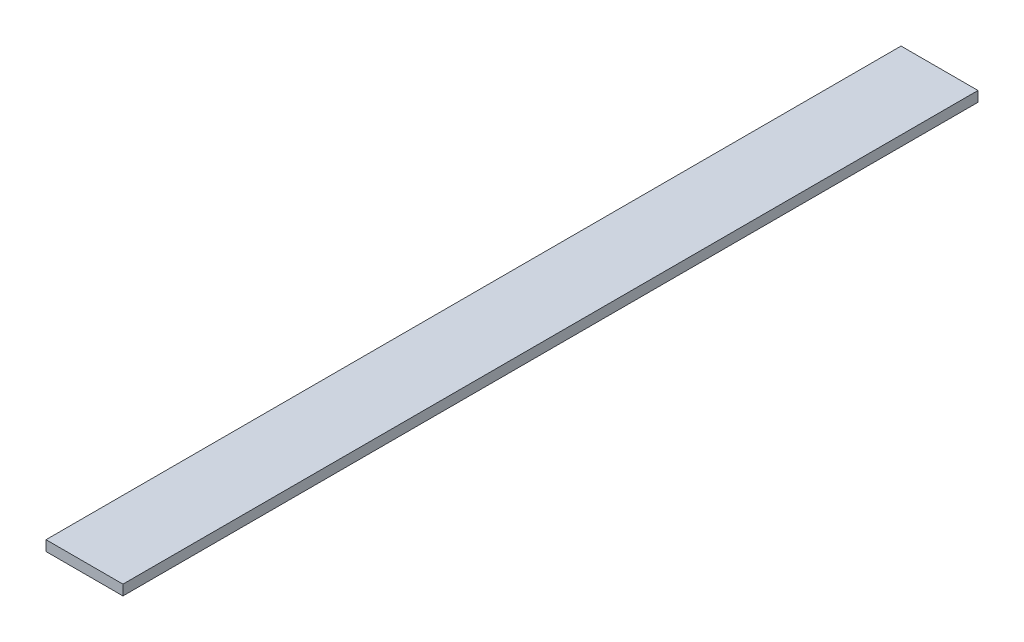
ISO-10303-21;
HEADER;
FILE_DESCRIPTION(('STEP AP214'),'2;1');
FILE_NAME('part.step','',(''),(''),'','','');
FILE_SCHEMA(('AUTOMOTIVE_DESIGN { 1 0 10303 214 1 1 1 1 }'));
ENDSEC;
DATA;
#1=APPLICATION_CONTEXT('core data for automotive mechanical design processes');
#2=APPLICATION_PROTOCOL_DEFINITION('international standard','automotive_design',2000,#1);
#3=PRODUCT_CONTEXT('',#1,'mechanical');
#4=PRODUCT('Part','Part','',(#3));
#5=PRODUCT_RELATED_PRODUCT_CATEGORY('part','',(#4));
#6=PRODUCT_DEFINITION_FORMATION('','',#4);
#7=PRODUCT_DEFINITION_CONTEXT('part definition',#1,'design');
#8=PRODUCT_DEFINITION('design','',#6,#7);
#9=PRODUCT_DEFINITION_SHAPE('','',#8);
#10=(LENGTH_UNIT() NAMED_UNIT(*) SI_UNIT(.MILLI.,.METRE.));
#11=(NAMED_UNIT(*) PLANE_ANGLE_UNIT() SI_UNIT($,.RADIAN.));
#12=(NAMED_UNIT(*) SI_UNIT($,.STERADIAN.) SOLID_ANGLE_UNIT());
#13=UNCERTAINTY_MEASURE_WITH_UNIT(LENGTH_MEASURE(1.E-05),#10,'distance_accuracy_value','');
#14=(GEOMETRIC_REPRESENTATION_CONTEXT(3) GLOBAL_UNCERTAINTY_ASSIGNED_CONTEXT((#13)) GLOBAL_UNIT_ASSIGNED_CONTEXT((#10,
#11,#12)) REPRESENTATION_CONTEXT('',''));
#15=CARTESIAN_POINT('',(0.,0.,0.));
#16=DIRECTION('',(0.,0.,1.));
#17=DIRECTION('',(1.,0.,0.));
#18=AXIS2_PLACEMENT_3D('',#15,#16,#17);
#19=CARTESIAN_POINT('',(22.5,0.,0.));
#20=DIRECTION('',(-1.,0.,0.));
#21=DIRECTION('',(0.,0.,1.));
#22=AXIS2_PLACEMENT_3D('',#19,#20,#21);
#23=PLANE('',#22);
#24=DIRECTION('',(0.,-1.,0.));
#25=VECTOR('',#24,1.);
#26=CARTESIAN_POINT('',(22.5,3.,0.));
#27=LINE('',#26,#25);
#28=CARTESIAN_POINT('',(22.5,6.,0.));
#29=VERTEX_POINT('',#28);
#30=CARTESIAN_POINT('',(22.5,0.,0.));
#31=VERTEX_POINT('',#30);
#32=EDGE_CURVE('E51',#29,#31,#27,.T.);
#33=ORIENTED_EDGE('',*,*,#32,.F.);
#34=DIRECTION('',(0.,0.,-1.));
#35=VECTOR('',#34,1.);
#36=CARTESIAN_POINT('',(22.5,6.,250.));
#37=LINE('',#36,#35);
#38=CARTESIAN_POINT('',(22.5,6.,500.));
#39=VERTEX_POINT('',#38);
#40=EDGE_CURVE('E66',#39,#29,#37,.T.);
#41=ORIENTED_EDGE('',*,*,#40,.F.);
#42=DIRECTION('',(0.,-1.,0.));
#43=VECTOR('',#42,1.);
#44=CARTESIAN_POINT('',(22.5,3.,500.));
#45=LINE('',#44,#43);
#46=CARTESIAN_POINT('',(22.5,0.,500.));
#47=VERTEX_POINT('',#46);
#48=EDGE_CURVE('E18',#39,#47,#45,.T.);
#49=ORIENTED_EDGE('',*,*,#48,.T.);
#50=DIRECTION('',(0.,0.,1.));
#51=VECTOR('',#50,1.);
#52=CARTESIAN_POINT('',(22.5,0.,250.));
#53=LINE('',#52,#51);
#54=EDGE_CURVE('E56',#31,#47,#53,.T.);
#55=ORIENTED_EDGE('',*,*,#54,.F.);
#56=EDGE_LOOP('',(#33,#41,#49,#55));
#57=FACE_BOUND('',#56,.T.);
#58=ADVANCED_FACE('F14',(#57),#23,.F.);
#59=CARTESIAN_POINT('',(22.5,0.,500.));
#60=DIRECTION('',(0.,0.,-1.));
#61=DIRECTION('',(-1.,0.,0.));
#62=AXIS2_PLACEMENT_3D('',#59,#60,#61);
#63=PLANE('',#62);
#64=DIRECTION('',(-1.,0.,0.));
#65=VECTOR('',#64,1.);
#66=CARTESIAN_POINT('',(0.,0.,500.));
#67=LINE('',#66,#65);
#68=CARTESIAN_POINT('',(-22.5,0.,500.));
#69=VERTEX_POINT('',#68);
#70=EDGE_CURVE('E61',#47,#69,#67,.T.);
#71=ORIENTED_EDGE('',*,*,#70,.F.);
#72=ORIENTED_EDGE('',*,*,#48,.F.);
#73=DIRECTION('',(1.,0.,0.));
#74=VECTOR('',#73,1.);
#75=CARTESIAN_POINT('',(0.,6.,500.));
#76=LINE('',#75,#74);
#77=CARTESIAN_POINT('',(-22.5,6.,500.));
#78=VERTEX_POINT('',#77);
#79=EDGE_CURVE('E79',#78,#39,#76,.T.);
#80=ORIENTED_EDGE('',*,*,#79,.F.);
#81=DIRECTION('',(0.,-1.,0.));
#82=VECTOR('',#81,1.);
#83=CARTESIAN_POINT('',(-22.5,3.,500.));
#84=LINE('',#83,#82);
#85=EDGE_CURVE('E72',#78,#69,#84,.T.);
#86=ORIENTED_EDGE('',*,*,#85,.T.);
#87=EDGE_LOOP('',(#71,#72,#80,#86));
#88=FACE_BOUND('',#87,.T.);
#89=ADVANCED_FACE('F71',(#88),#63,.F.);
#90=CARTESIAN_POINT('',(-22.5,0.,500.));
#91=DIRECTION('',(0.,-1.,0.));
#92=DIRECTION('',(0.,0.,-1.));
#93=AXIS2_PLACEMENT_3D('',#90,#91,#92);
#94=PLANE('',#93);
#95=ORIENTED_EDGE('',*,*,#70,.T.);
#96=DIRECTION('',(0.,0.,-1.));
#97=VECTOR('',#96,1.);
#98=CARTESIAN_POINT('',(-22.5,0.,250.));
#99=LINE('',#98,#97);
#100=CARTESIAN_POINT('',(-22.5,0.,0.));
#101=VERTEX_POINT('',#100);
#102=EDGE_CURVE('E82',#69,#101,#99,.T.);
#103=ORIENTED_EDGE('',*,*,#102,.T.);
#104=DIRECTION('',(-1.,0.,0.));
#105=VECTOR('',#104,1.);
#106=CARTESIAN_POINT('',(0.,0.,0.));
#107=LINE('',#106,#105);
#108=EDGE_CURVE('E63',#31,#101,#107,.T.);
#109=ORIENTED_EDGE('',*,*,#108,.F.);
#110=ORIENTED_EDGE('',*,*,#54,.T.);
#111=EDGE_LOOP('',(#95,#103,#109,#110));
#112=FACE_BOUND('',#111,.T.);
#113=ADVANCED_FACE('F58',(#112),#94,.T.);
#114=CARTESIAN_POINT('',(22.5,0.,0.));
#115=DIRECTION('',(0.,0.,-1.));
#116=DIRECTION('',(-1.,0.,0.));
#117=AXIS2_PLACEMENT_3D('',#114,#115,#116);
#118=PLANE('',#117);
#119=ORIENTED_EDGE('',*,*,#32,.T.);
#120=ORIENTED_EDGE('',*,*,#108,.T.);
#121=DIRECTION('',(0.,1.,0.));
#122=VECTOR('',#121,1.);
#123=CARTESIAN_POINT('',(-22.5,3.,0.));
#124=LINE('',#123,#122);
#125=CARTESIAN_POINT('',(-22.5,6.,0.));
#126=VERTEX_POINT('',#125);
#127=EDGE_CURVE('E24',#101,#126,#124,.T.);
#128=ORIENTED_EDGE('',*,*,#127,.T.);
#129=DIRECTION('',(-1.,0.,0.));
#130=VECTOR('',#129,1.);
#131=CARTESIAN_POINT('',(0.,6.,0.));
#132=LINE('',#131,#130);
#133=EDGE_CURVE('E32',#29,#126,#132,.T.);
#134=ORIENTED_EDGE('',*,*,#133,.F.);
#135=EDGE_LOOP('',(#119,#120,#128,#134));
#136=FACE_BOUND('',#135,.T.);
#137=ADVANCED_FACE('F86',(#136),#118,.T.);
#138=CARTESIAN_POINT('',(22.5,6.,0.));
#139=DIRECTION('',(0.,1.,0.));
#140=DIRECTION('',(-1.,0.,0.));
#141=AXIS2_PLACEMENT_3D('',#138,#139,#140);
#142=PLANE('',#141);
#143=DIRECTION('',(0.,0.,1.));
#144=VECTOR('',#143,1.);
#145=CARTESIAN_POINT('',(-22.5,6.,250.));
#146=LINE('',#145,#144);
#147=EDGE_CURVE('E9',#126,#78,#146,.T.);
#148=ORIENTED_EDGE('',*,*,#147,.T.);
#149=ORIENTED_EDGE('',*,*,#79,.T.);
#150=ORIENTED_EDGE('',*,*,#40,.T.);
#151=ORIENTED_EDGE('',*,*,#133,.T.);
#152=EDGE_LOOP('',(#148,#149,#150,#151));
#153=FACE_BOUND('',#152,.T.);
#154=ADVANCED_FACE('F88',(#153),#142,.T.);
#155=CARTESIAN_POINT('',(-22.5,0.,500.));
#156=DIRECTION('',(1.,0.,0.));
#157=DIRECTION('',(0.,0.,-1.));
#158=AXIS2_PLACEMENT_3D('',#155,#156,#157);
#159=PLANE('',#158);
#160=ORIENTED_EDGE('',*,*,#127,.F.);
#161=ORIENTED_EDGE('',*,*,#102,.F.);
#162=ORIENTED_EDGE('',*,*,#85,.F.);
#163=ORIENTED_EDGE('',*,*,#147,.F.);
#164=EDGE_LOOP('',(#160,#161,#162,#163));
#165=FACE_BOUND('',#164,.T.);
#166=ADVANCED_FACE('F16',(#165),#159,.F.);
#167=CLOSED_SHELL('',(#58,#89,#113,#137,#154,#166));
#168=MANIFOLD_SOLID_BREP('B1',#167);
#169=ADVANCED_BREP_SHAPE_REPRESENTATION('',(#18,#168),#14);
#170=SHAPE_DEFINITION_REPRESENTATION(#9,#169);
ENDSEC;
END-ISO-10303-21;
